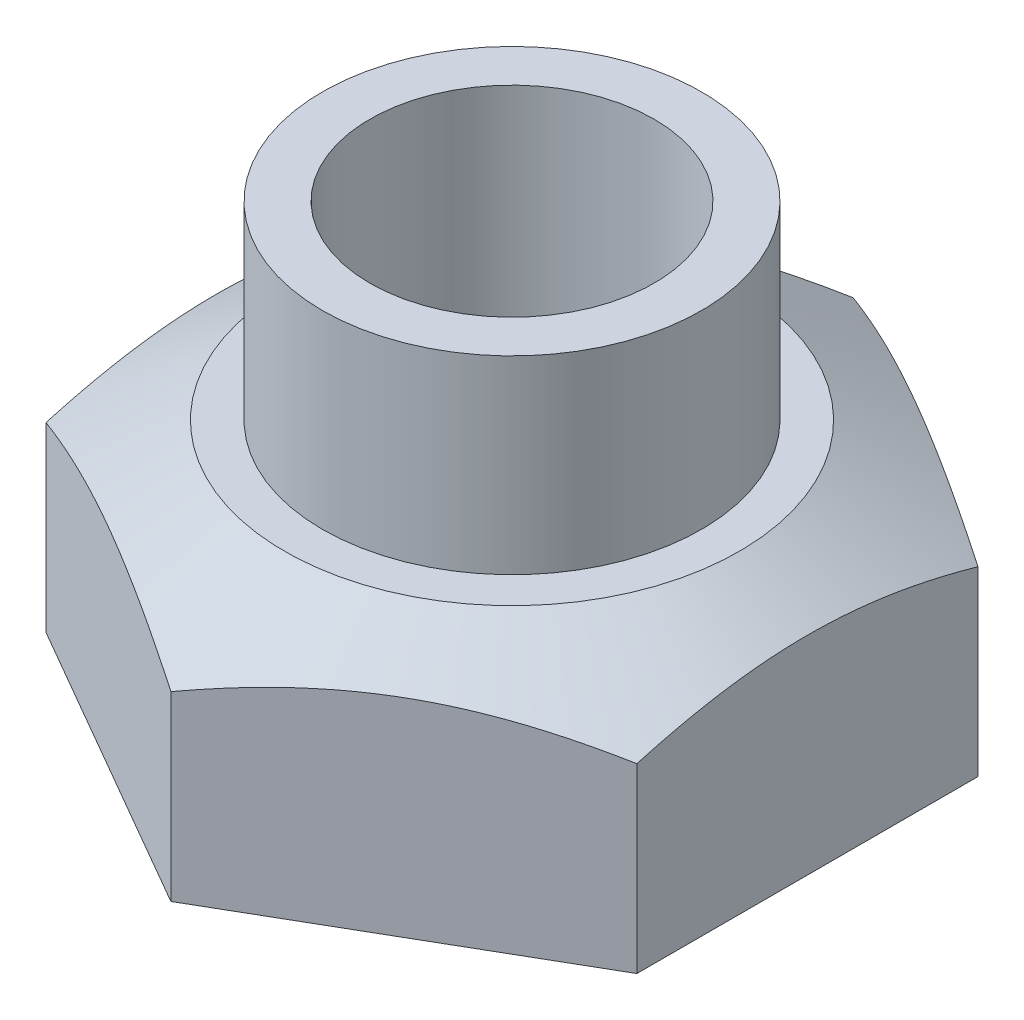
from build123d import *

# Parameters (mm, degrees)
BOSS_EXTRUDE1_DEPTH = 65
SKETCH3_R           = 37.5
CUT_EXTRUDE1_DEPTH  = 65
BOSS_EXTRUDE2_START = 50
SKETCH4_R           = 50
SKETCH4_R_2         = 37.5
BOSS_EXTRUDE2_DEPTH = 50


with BuildPart() as part:
    # Sketch1 → Boss-Extrude1 (new body)
    with BuildSketch(Plane(origin=(0, 0, 0), x_dir=(1, 0, 0), z_dir=(0, 1, 0))):
        Polygon((0, -90), (77.942286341, -45), (77.942286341, 45), (0, 90), (-77.942286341, 45), (-77.942286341, -45), align=None)
    extrude(amount=BOSS_EXTRUDE1_DEPTH)

    # Sketch2 → Cut-Revolve2 (revolve, cut)
    with BuildSketch(Plane(origin=(0, 0, 0), x_dir=(0, 0, -1), z_dir=(1, 0, 0))):
        Polygon((60, 65), (112.796667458, 95), (112.796667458, 35), align=None)
    revolve(axis=Axis((0, 0, 0), (0, 1, 0)), mode=Mode.SUBTRACT)

    # Sketch3 → Cut-Extrude1 (cut)
    with BuildSketch(Plane(origin=(0, 65, 0), x_dir=(1, 0, 0), z_dir=(0, 1, 0))):
        with Locations(Location((0, 0, 0), (0, 0, 270))):
            Circle(SKETCH3_R)
    extrude(amount=-CUT_EXTRUDE1_DEPTH, mode=Mode.SUBTRACT)

    # Sketch4 → Boss-Extrude2 (add)
    with BuildSketch(Plane(origin=(0, 65, 0), x_dir=(1, 0, 0), z_dir=(0, 1, 0)).offset(BOSS_EXTRUDE2_START)):
        with Locations(Location((0, 0, 0), (0, 0, 270))):
            Circle(SKETCH4_R)
        with Locations(Location((0, 0, 0), (0, 0, 270))):
            Circle(SKETCH4_R_2, mode=Mode.SUBTRACT)
    extrude(amount=-BOSS_EXTRUDE2_DEPTH)


solid = part.part
